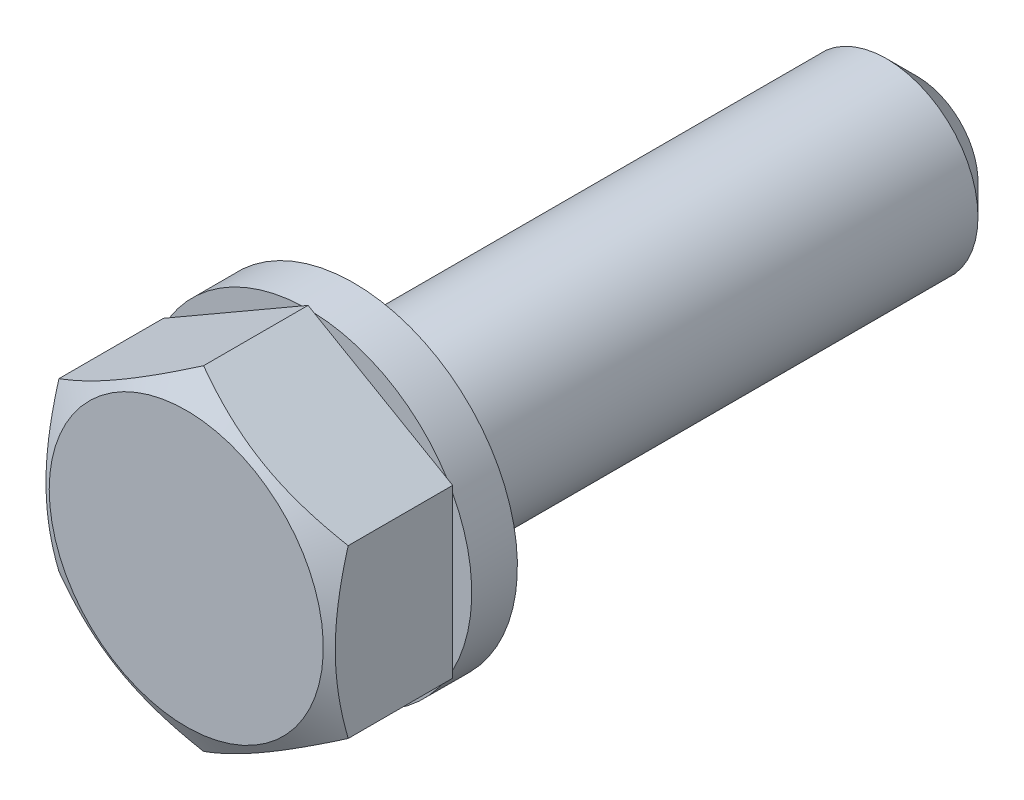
ISO-10303-21;
HEADER;
FILE_DESCRIPTION(('STEP AP214'),'2;1');
FILE_NAME('part.step','',(''),(''),'','','');
FILE_SCHEMA(('AUTOMOTIVE_DESIGN { 1 0 10303 214 1 1 1 1 }'));
ENDSEC;
DATA;
#1=APPLICATION_CONTEXT('core data for automotive mechanical design processes');
#2=APPLICATION_PROTOCOL_DEFINITION('international standard','automotive_design',2000,#1);
#3=PRODUCT_CONTEXT('',#1,'mechanical');
#4=PRODUCT('Part','Part','',(#3));
#5=PRODUCT_RELATED_PRODUCT_CATEGORY('part','',(#4));
#6=PRODUCT_DEFINITION_FORMATION('','',#4);
#7=PRODUCT_DEFINITION_CONTEXT('part definition',#1,'design');
#8=PRODUCT_DEFINITION('design','',#6,#7);
#9=PRODUCT_DEFINITION_SHAPE('','',#8);
#10=(LENGTH_UNIT() NAMED_UNIT(*) SI_UNIT(.MILLI.,.METRE.));
#11=(NAMED_UNIT(*) PLANE_ANGLE_UNIT() SI_UNIT($,.RADIAN.));
#12=(NAMED_UNIT(*) SI_UNIT($,.STERADIAN.) SOLID_ANGLE_UNIT());
#13=UNCERTAINTY_MEASURE_WITH_UNIT(LENGTH_MEASURE(1.E-05),#10,'distance_accuracy_value','');
#14=(GEOMETRIC_REPRESENTATION_CONTEXT(3) GLOBAL_UNCERTAINTY_ASSIGNED_CONTEXT((#13)) GLOBAL_UNIT_ASSIGNED_CONTEXT((#10,
#11,#12)) REPRESENTATION_CONTEXT('',''));
#15=CARTESIAN_POINT('',(0.,0.,0.));
#16=DIRECTION('',(0.,0.,1.));
#17=DIRECTION('',(1.,0.,0.));
#18=AXIS2_PLACEMENT_3D('',#15,#16,#17);
#19=CARTESIAN_POINT('',(0.,10.9696551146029,0.));
#20=DIRECTION('',(0.,0.,1.));
#21=DIRECTION('',(1.,0.,0.));
#22=AXIS2_PLACEMENT_3D('',#19,#20,#21);
#23=PLANE('',#22);
#24=CARTESIAN_POINT('',(0.,0.,0.));
#25=DIRECTION('',(0.,0.,-1.));
#26=DIRECTION('',(-1.,0.,0.));
#27=AXIS2_PLACEMENT_3D('',#24,#25,#26);
#28=CIRCLE('',#27,6.1);
#29=CARTESIAN_POINT('',(-6.1,0.,0.));
#30=VERTEX_POINT('',#29);
#31=EDGE_CURVE('E331',#30,#30,#28,.T.);
#32=ORIENTED_EDGE('',*,*,#31,.T.);
#33=EDGE_LOOP('',(#32));
#34=FACE_BOUND('',#33,.T.);
#35=CARTESIAN_POINT('',(0.,0.,0.));
#36=DIRECTION('',(0.,0.,1.));
#37=DIRECTION('',(1.,0.,0.));
#38=AXIS2_PLACEMENT_3D('',#35,#36,#37);
#39=CIRCLE('',#38,6.);
#40=CARTESIAN_POINT('',(6.,0.,0.));
#41=VERTEX_POINT('',#40);
#42=EDGE_CURVE('E175',#41,#41,#39,.F.);
#43=ORIENTED_EDGE('',*,*,#42,.F.);
#44=EDGE_LOOP('',(#43));
#45=FACE_BOUND('',#44,.T.);
#46=ADVANCED_FACE('F14',(#34,#45),#23,.F.);
#47=CARTESIAN_POINT('',(0.,0.,-40.));
#48=DIRECTION('',(0.,0.,1.));
#49=DIRECTION('',(1.,0.,0.));
#50=AXIS2_PLACEMENT_3D('',#47,#48,#49);
#51=CYLINDRICAL_SURFACE('',#50,6.);
#52=CARTESIAN_POINT('',(0.,0.,-38.));
#53=DIRECTION('',(0.,0.,-1.));
#54=DIRECTION('',(-1.,0.,0.));
#55=AXIS2_PLACEMENT_3D('',#52,#53,#54);
#56=CIRCLE('',#55,6.);
#57=CARTESIAN_POINT('',(-6.,0.,-38.));
#58=VERTEX_POINT('',#57);
#59=EDGE_CURVE('E9',#58,#58,#56,.F.);
#60=ORIENTED_EDGE('',*,*,#59,.T.);
#61=EDGE_LOOP('',(#60));
#62=FACE_BOUND('',#61,.T.);
#63=ORIENTED_EDGE('',*,*,#42,.T.);
#64=EDGE_LOOP('',(#63));
#65=FACE_BOUND('',#64,.T.);
#66=ADVANCED_FACE('F195',(#62,#65),#51,.T.);
#67=CARTESIAN_POINT('',(0.,0.,-40.));
#68=DIRECTION('',(0.,0.,-1.));
#69=DIRECTION('',(-1.,0.,0.));
#70=AXIS2_PLACEMENT_3D('',#67,#68,#69);
#71=PLANE('',#70);
#72=CARTESIAN_POINT('',(0.,0.,-40.));
#73=DIRECTION('',(0.,0.,-1.));
#74=DIRECTION('',(-1.,0.,0.));
#75=AXIS2_PLACEMENT_3D('',#72,#73,#74);
#76=CIRCLE('',#75,4.);
#77=CARTESIAN_POINT('',(-4.,0.,-40.));
#78=VERTEX_POINT('',#77);
#79=EDGE_CURVE('E22',#78,#78,#76,.T.);
#80=ORIENTED_EDGE('',*,*,#79,.T.);
#81=EDGE_LOOP('',(#80));
#82=FACE_BOUND('',#81,.T.);
#83=ADVANCED_FACE('F180',(#82),#71,.T.);
#84=CARTESIAN_POINT('',(0.,0.,-40.));
#85=DIRECTION('',(0.,0.,1.));
#86=DIRECTION('',(1.,0.,0.));
#87=AXIS2_PLACEMENT_3D('',#84,#85,#86);
#88=CONICAL_SURFACE('',#87,4.,0.785398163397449);
#89=ORIENTED_EDGE('',*,*,#59,.F.);
#90=EDGE_LOOP('',(#89));
#91=FACE_BOUND('',#90,.T.);
#92=ORIENTED_EDGE('',*,*,#79,.F.);
#93=EDGE_LOOP('',(#92));
#94=FACE_BOUND('',#93,.T.);
#95=ADVANCED_FACE('F16',(#91,#94),#88,.T.);
#96=CARTESIAN_POINT('',(0.,0.,0.));
#97=DIRECTION('',(0.,0.,-1.));
#98=DIRECTION('',(-1.,0.,0.));
#99=AXIS2_PLACEMENT_3D('',#96,#97,#98);
#100=PLANE('',#99);
#101=CARTESIAN_POINT('',(0.,0.,0.));
#102=DIRECTION('',(0.,0.,-1.));
#103=DIRECTION('',(-1.,0.,0.));
#104=AXIS2_PLACEMENT_3D('',#101,#102,#103);
#105=CIRCLE('',#104,10.75);
#106=CARTESIAN_POINT('',(0.392893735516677,10.7428178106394,0.));
#107=VERTEX_POINT('',#106);
#108=CARTESIAN_POINT('',(9.10710626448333,5.71166486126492,0.));
#109=VERTEX_POINT('',#108);
#110=EDGE_CURVE('E233',#107,#109,#105,.T.);
#111=ORIENTED_EDGE('',*,*,#110,.F.);
#112=DIRECTION('',(0.866025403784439,-0.5,0.));
#113=VECTOR('',#112,1.);
#114=CARTESIAN_POINT('',(9.5,5.48482755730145,0.));
#115=LINE('',#114,#113);
#116=EDGE_CURVE('E237',#107,#109,#115,.T.);
#117=ORIENTED_EDGE('',*,*,#116,.T.);
#118=EDGE_LOOP('',(#111,#117));
#119=FACE_BOUND('',#118,.T.);
#120=ADVANCED_FACE('F183',(#119),#100,.F.);
#121=CARTESIAN_POINT('',(-9.10710626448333,5.71166486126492,0.));
#122=VERTEX_POINT('',#121);
#123=CARTESIAN_POINT('',(-0.39289373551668,10.7428178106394,0.));
#124=VERTEX_POINT('',#123);
#125=EDGE_CURVE('E133',#122,#124,#105,.T.);
#126=ORIENTED_EDGE('',*,*,#125,.F.);
#127=DIRECTION('',(0.866025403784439,0.5,0.));
#128=VECTOR('',#127,1.);
#129=CARTESIAN_POINT('',(0.,10.9696551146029,0.));
#130=LINE('',#129,#128);
#131=EDGE_CURVE('E111',#122,#124,#130,.T.);
#132=ORIENTED_EDGE('',*,*,#131,.T.);
#133=EDGE_LOOP('',(#126,#132));
#134=FACE_BOUND('',#133,.T.);
#135=ADVANCED_FACE('F191',(#134),#100,.F.);
#136=CARTESIAN_POINT('',(-9.5,-5.03115294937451,0.));
#137=VERTEX_POINT('',#136);
#138=CARTESIAN_POINT('',(-9.5,5.03115294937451,0.));
#139=VERTEX_POINT('',#138);
#140=EDGE_CURVE('E107',#137,#139,#105,.T.);
#141=ORIENTED_EDGE('',*,*,#140,.F.);
#142=DIRECTION('',(0.,1.,0.));
#143=VECTOR('',#142,1.);
#144=CARTESIAN_POINT('',(-9.5,5.48482755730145,0.));
#145=LINE('',#144,#143);
#146=EDGE_CURVE('E104',#137,#139,#145,.T.);
#147=ORIENTED_EDGE('',*,*,#146,.T.);
#148=EDGE_LOOP('',(#141,#147));
#149=FACE_BOUND('',#148,.T.);
#150=ADVANCED_FACE('F106',(#149),#100,.F.);
#151=CARTESIAN_POINT('',(-0.392893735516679,-10.7428178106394,0.));
#152=VERTEX_POINT('',#151);
#153=CARTESIAN_POINT('',(-9.10710626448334,-5.71166486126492,0.));
#154=VERTEX_POINT('',#153);
#155=EDGE_CURVE('E525',#152,#154,#105,.T.);
#156=ORIENTED_EDGE('',*,*,#155,.F.);
#157=DIRECTION('',(-0.866025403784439,0.5,0.));
#158=VECTOR('',#157,1.);
#159=CARTESIAN_POINT('',(-9.5,-5.48482755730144,0.));
#160=LINE('',#159,#158);
#161=EDGE_CURVE('E112',#152,#154,#160,.T.);
#162=ORIENTED_EDGE('',*,*,#161,.T.);
#163=EDGE_LOOP('',(#156,#162));
#164=FACE_BOUND('',#163,.T.);
#165=ADVANCED_FACE('F435',(#164),#100,.F.);
#166=CARTESIAN_POINT('',(9.10710626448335,-5.7116648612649,0.));
#167=VERTEX_POINT('',#166);
#168=CARTESIAN_POINT('',(0.392893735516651,-10.7428178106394,0.));
#169=VERTEX_POINT('',#168);
#170=EDGE_CURVE('E524',#167,#169,#105,.T.);
#171=ORIENTED_EDGE('',*,*,#170,.F.);
#172=DIRECTION('',(-0.866025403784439,-0.5,0.));
#173=VECTOR('',#172,1.);
#174=CARTESIAN_POINT('',(0.,-10.9696551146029,0.));
#175=LINE('',#174,#173);
#176=EDGE_CURVE('E326',#167,#169,#175,.T.);
#177=ORIENTED_EDGE('',*,*,#176,.T.);
#178=EDGE_LOOP('',(#171,#177));
#179=FACE_BOUND('',#178,.T.);
#180=ADVANCED_FACE('F350',(#179),#100,.F.);
#181=CARTESIAN_POINT('',(9.5,5.03115294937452,0.));
#182=VERTEX_POINT('',#181);
#183=CARTESIAN_POINT('',(9.5,-5.03115294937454,0.));
#184=VERTEX_POINT('',#183);
#185=EDGE_CURVE('E234',#182,#184,#105,.T.);
#186=ORIENTED_EDGE('',*,*,#185,.F.);
#187=DIRECTION('',(0.,1.,0.));
#188=VECTOR('',#187,1.);
#189=CARTESIAN_POINT('',(9.5,-5.48482755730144,0.));
#190=LINE('',#189,#188);
#191=EDGE_CURVE('E159',#184,#182,#190,.T.);
#192=ORIENTED_EDGE('',*,*,#191,.F.);
#193=EDGE_LOOP('',(#186,#192));
#194=FACE_BOUND('',#193,.T.);
#195=ADVANCED_FACE('F194',(#194),#100,.F.);
#196=CARTESIAN_POINT('',(0.,0.,-3.));
#197=DIRECTION('',(0.,0.,-1.));
#198=DIRECTION('',(-1.,0.,0.));
#199=AXIS2_PLACEMENT_3D('',#196,#197,#198);
#200=PLANE('',#199);
#201=CARTESIAN_POINT('',(0.,0.,-3.));
#202=DIRECTION('',(0.,0.,-1.));
#203=DIRECTION('',(-1.,0.,0.));
#204=AXIS2_PLACEMENT_3D('',#201,#202,#203);
#205=CIRCLE('',#204,10.75);
#206=CARTESIAN_POINT('',(-10.75,0.,-3.));
#207=VERTEX_POINT('',#206);
#208=EDGE_CURVE('E132',#207,#207,#205,.T.);
#209=ORIENTED_EDGE('',*,*,#208,.T.);
#210=EDGE_LOOP('',(#209));
#211=FACE_BOUND('',#210,.T.);
#212=CARTESIAN_POINT('',(0.,0.,-3.));
#213=DIRECTION('',(0.,0.,-1.));
#214=DIRECTION('',(-1.,0.,0.));
#215=AXIS2_PLACEMENT_3D('',#212,#213,#214);
#216=CIRCLE('',#215,6.1);
#217=CARTESIAN_POINT('',(-6.1,0.,-3.));
#218=VERTEX_POINT('',#217);
#219=EDGE_CURVE('E124',#218,#218,#216,.T.);
#220=ORIENTED_EDGE('',*,*,#219,.F.);
#221=EDGE_LOOP('',(#220));
#222=FACE_BOUND('',#221,.T.);
#223=ADVANCED_FACE('F339',(#211,#222),#200,.T.);
#224=CARTESIAN_POINT('',(0.,0.,-3.));
#225=DIRECTION('',(0.,0.,1.));
#226=DIRECTION('',(1.,0.,0.));
#227=AXIS2_PLACEMENT_3D('',#224,#225,#226);
#228=CYLINDRICAL_SURFACE('',#227,10.75);
#229=ORIENTED_EDGE('',*,*,#208,.F.);
#230=EDGE_LOOP('',(#229));
#231=FACE_BOUND('',#230,.T.);
#232=EDGE_CURVE('E118',#139,#122,#105,.T.);
#233=ORIENTED_EDGE('',*,*,#232,.T.);
#234=ORIENTED_EDGE('',*,*,#125,.T.);
#235=EDGE_CURVE('E539',#124,#107,#105,.T.);
#236=ORIENTED_EDGE('',*,*,#235,.T.);
#237=ORIENTED_EDGE('',*,*,#110,.T.);
#238=EDGE_CURVE('E29',#109,#182,#105,.T.);
#239=ORIENTED_EDGE('',*,*,#238,.T.);
#240=ORIENTED_EDGE('',*,*,#185,.T.);
#241=EDGE_CURVE('E530',#184,#167,#105,.T.);
#242=ORIENTED_EDGE('',*,*,#241,.T.);
#243=ORIENTED_EDGE('',*,*,#170,.T.);
#244=EDGE_CURVE('E522',#169,#152,#105,.T.);
#245=ORIENTED_EDGE('',*,*,#244,.T.);
#246=ORIENTED_EDGE('',*,*,#155,.T.);
#247=EDGE_CURVE('E122',#154,#137,#105,.T.);
#248=ORIENTED_EDGE('',*,*,#247,.T.);
#249=ORIENTED_EDGE('',*,*,#140,.T.);
#250=EDGE_LOOP('',(#233,#234,#236,#237,#239,#240,#242,#243,#245,#246,#248,#249));
#251=FACE_BOUND('',#250,.T.);
#252=ADVANCED_FACE('F116',(#231,#251),#228,.T.);
#253=CARTESIAN_POINT('',(0.,0.,-3.));
#254=DIRECTION('',(0.,0.,1.));
#255=DIRECTION('',(1.,0.,0.));
#256=AXIS2_PLACEMENT_3D('',#253,#254,#255);
#257=CYLINDRICAL_SURFACE('',#256,6.1);
#258=ORIENTED_EDGE('',*,*,#219,.T.);
#259=EDGE_LOOP('',(#258));
#260=FACE_BOUND('',#259,.T.);
#261=ORIENTED_EDGE('',*,*,#31,.F.);
#262=EDGE_LOOP('',(#261));
#263=FACE_BOUND('',#262,.T.);
#264=ADVANCED_FACE('F336',(#260,#263),#257,.F.);
#265=CARTESIAN_POINT('',(0.,10.9696551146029,8.));
#266=DIRECTION('',(0.,0.,1.));
#267=DIRECTION('',(1.,0.,0.));
#268=AXIS2_PLACEMENT_3D('',#265,#266,#267);
#269=PLANE('',#268);
#270=CARTESIAN_POINT('',(0.,0.,8.));
#271=DIRECTION('',(0.,0.,-1.));
#272=DIRECTION('',(-1.,0.,0.));
#273=AXIS2_PLACEMENT_3D('',#270,#271,#272);
#274=CIRCLE('',#273,9.);
#275=CARTESIAN_POINT('',(-9.,0.,8.));
#276=VERTEX_POINT('',#275);
#277=EDGE_CURVE('E309',#276,#276,#274,.T.);
#278=ORIENTED_EDGE('',*,*,#277,.F.);
#279=EDGE_LOOP('',(#278));
#280=FACE_BOUND('',#279,.T.);
#281=ADVANCED_FACE('F261',(#280),#269,.T.);
#282=CARTESIAN_POINT('',(0.,0.,8.));
#283=DIRECTION('',(0.,0.,-1.));
#284=DIRECTION('',(-1.,0.,0.));
#285=AXIS2_PLACEMENT_3D('',#282,#283,#284);
#286=CONICAL_SURFACE('',#285,9.,1.0471975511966);
#287=ORIENTED_EDGE('',*,*,#277,.T.);
#288=EDGE_LOOP('',(#287));
#289=FACE_BOUND('',#288,.T.);
#290=CARTESIAN_POINT('',(-9.5002,5.48471208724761,6.86275242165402));
#291=CARTESIAN_POINT('',(-9.2913692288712,5.6052805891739,6.93235142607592));
#292=CARTESIAN_POINT('',(-9.0817598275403,5.72629863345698,6.99879155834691));
#293=CARTESIAN_POINT('',(-8.66086011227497,5.96930519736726,7.1244775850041));
#294=CARTESIAN_POINT('',(-8.44956926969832,6.09129402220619,7.18372111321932));
#295=CARTESIAN_POINT('',(-7.81229220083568,6.4592261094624,7.34951029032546));
#296=CARTESIAN_POINT('',(-7.38379023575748,6.70662183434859,7.44381042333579));
#297=CARTESIAN_POINT('',(-6.74255666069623,7.07683821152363,7.55438616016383));
#298=CARTESIAN_POINT('',(-6.53174078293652,7.19855281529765,7.58588503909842));
#299=CARTESIAN_POINT('',(-6.10913296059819,7.44254555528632,7.6387066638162));
#300=CARTESIAN_POINT('',(-5.89734099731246,7.56482370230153,7.66002921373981));
#301=CARTESIAN_POINT('',(-5.47340378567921,7.80958396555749,7.69195184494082));
#302=CARTESIAN_POINT('',(-5.26125925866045,7.93206566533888,7.70256466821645));
#303=CARTESIAN_POINT('',(-4.83677424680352,8.17714220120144,7.71284233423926));
#304=CARTESIAN_POINT('',(-4.62443376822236,8.29973703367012,7.71250751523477));
#305=CARTESIAN_POINT('',(-4.22745800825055,8.52893109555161,7.70165149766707));
#306=CARTESIAN_POINT('',(-4.04279470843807,8.63554650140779,7.6924545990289));
#307=CARTESIAN_POINT('',(-3.67389999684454,8.84852796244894,7.6659594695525));
#308=CARTESIAN_POINT('',(-3.48966861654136,8.95489399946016,7.64866066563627));
#309=CARTESIAN_POINT('',(-2.937688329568,9.27357996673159,7.585020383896));
#310=CARTESIAN_POINT('',(-2.57091646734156,9.48533580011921,7.52694296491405));
#311=CARTESIAN_POINT('',(-1.83348217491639,9.91109368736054,7.38174885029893));
#312=CARTESIAN_POINT('',(-1.46291385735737,10.1250414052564,7.29401669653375));
#313=CARTESIAN_POINT('',(-0.727303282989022,10.5497463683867,7.0949011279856));
#314=CARTESIAN_POINT('',(-0.362251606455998,10.7605090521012,6.98356447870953));
#315=CARTESIAN_POINT('',(0.000200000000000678,10.9697705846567,6.86275242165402));
#316=B_SPLINE_CURVE_WITH_KNOTS('',3,(#290,#291,#292,#293,#294,#295,#296,#297,#298,#299,#300,
#301,#302,#303,#304,#305,#306,#307,#308,#309,#310,#311,#312,#313,#314,#315),.UNSPECIFIED.,.F.,
.F.,(4,2,2,2,2,2,2,2,2,2,2,2,4),(0.,0.752880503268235,1.50600787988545,3.0154687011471,
3.75167336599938,4.48789219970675,5.22323407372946,5.95855322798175,6.59868084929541,
7.23885375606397,8.52010929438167,9.82978009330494,11.1368800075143),.UNSPECIFIED.);
#317=CARTESIAN_POINT('',(-9.5,5.48482755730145,6.86281908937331));
#318=VERTEX_POINT('',#317);
#319=CARTESIAN_POINT('',(0.,10.9696551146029,6.86281908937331));
#320=VERTEX_POINT('',#319);
#321=EDGE_CURVE('E249',#318,#320,#316,.T.);
#322=ORIENTED_EDGE('',*,*,#321,.F.);
#323=CARTESIAN_POINT('',(-9.5,-14.6169548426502,3.13127340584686));
#324=CARTESIAN_POINT('',(-9.5,-14.4099741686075,3.23146887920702));
#325=CARTESIAN_POINT('',(-9.5,-14.202747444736,3.33115583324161));
#326=CARTESIAN_POINT('',(-9.5,-13.7877505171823,3.52939728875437));
#327=CARTESIAN_POINT('',(-9.5,-13.5799803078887,3.62795177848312));
#328=CARTESIAN_POINT('',(-9.5,-12.9557203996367,3.92177017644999));
#329=CARTESIAN_POINT('',(-9.5,-12.5383444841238,4.11515839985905));
#330=CARTESIAN_POINT('',(-9.5,-11.6984328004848,4.49680738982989));
#331=CARTESIAN_POINT('',(-9.5,-11.275881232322,4.68503347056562));
#332=CARTESIAN_POINT('',(-9.5,-10.427377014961,5.05362894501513));
#333=CARTESIAN_POINT('',(-9.5,-10.0014245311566,5.23399871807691));
#334=CARTESIAN_POINT('',(-9.5,-9.1321608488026,5.59024054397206));
#335=CARTESIAN_POINT('',(-9.5,-8.68872080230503,5.76579995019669));
#336=CARTESIAN_POINT('',(-9.5,-7.79661127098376,6.10334897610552));
#337=CARTESIAN_POINT('',(-9.5,-7.34794119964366,6.26533705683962));
#338=CARTESIAN_POINT('',(-9.5,-6.44553024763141,6.57140492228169));
#339=CARTESIAN_POINT('',(-9.5,-5.9918021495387,6.71552198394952));
#340=CARTESIAN_POINT('',(-9.5,-5.07785587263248,6.98114937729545));
#341=CARTESIAN_POINT('',(-9.5,-4.61763982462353,7.10266695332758));
#342=CARTESIAN_POINT('',(-9.5,-3.69290280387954,7.31654154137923));
#343=CARTESIAN_POINT('',(-9.5,-3.22841826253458,7.40905177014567));
#344=CARTESIAN_POINT('',(-9.5,-2.52755616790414,7.52199749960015));
#345=CARTESIAN_POINT('',(-9.5,-2.29322816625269,7.55534437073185));
#346=CARTESIAN_POINT('',(-9.5,-1.82344730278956,7.61277502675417));
#347=CARTESIAN_POINT('',(-9.5,-1.58799455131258,7.6368597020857));
#348=CARTESIAN_POINT('',(-9.5,-1.11930437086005,7.67498999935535));
#349=CARTESIAN_POINT('',(-9.5,-0.886077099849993,7.68916002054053));
#350=CARTESIAN_POINT('',(-9.5,-0.419232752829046,7.70763310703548));
#351=CARTESIAN_POINT('',(-9.5,-0.185615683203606,7.71193633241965));
#352=CARTESIAN_POINT('',(-9.5,0.281592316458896,7.71057344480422));
#353=CARTESIAN_POINT('',(-9.5,0.515183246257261,7.70490724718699));
#354=CARTESIAN_POINT('',(-9.5,0.981922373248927,7.68374176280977));
#355=CARTESIAN_POINT('',(-9.5,1.2150705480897,7.66824199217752));
#356=CARTESIAN_POINT('',(-9.5,1.77895072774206,7.61918755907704));
#357=CARTESIAN_POINT('',(-9.5,2.10926686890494,7.5807701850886));
#358=CARTESIAN_POINT('',(-9.5,2.7673725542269,7.48631778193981));
#359=CARTESIAN_POINT('',(-9.5,3.09516173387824,7.43028025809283));
#360=CARTESIAN_POINT('',(-9.5,3.7479266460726,7.30258122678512));
#361=CARTESIAN_POINT('',(-9.5,4.07289990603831,7.23090720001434));
#362=CARTESIAN_POINT('',(-9.5,4.71955029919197,7.07411533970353));
#363=CARTESIAN_POINT('',(-9.5,5.04122748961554,6.98899774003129));
#364=CARTESIAN_POINT('',(-9.5,5.68830445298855,6.80538640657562));
#365=CARTESIAN_POINT('',(-9.5,6.01363245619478,6.70664147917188));
#366=CARTESIAN_POINT('',(-9.5,6.66108251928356,6.4992006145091));
#367=CARTESIAN_POINT('',(-9.5,6.98320455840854,6.39050461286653));
#368=CARTESIAN_POINT('',(-9.5,7.62440641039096,6.16486538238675));
#369=CARTESIAN_POINT('',(-9.5,7.94348725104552,6.04792506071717));
#370=CARTESIAN_POINT('',(-9.5,8.57902170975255,5.80714824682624));
#371=CARTESIAN_POINT('',(-9.5,8.89547535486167,5.68331182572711));
#372=CARTESIAN_POINT('',(-9.5,9.62674986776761,5.38942439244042));
#373=CARTESIAN_POINT('',(-9.5,10.0407133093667,5.21724339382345));
#374=CARTESIAN_POINT('',(-9.5,10.8652589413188,4.86494520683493));
#375=CARTESIAN_POINT('',(-9.5,11.2758409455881,4.68482758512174));
#376=CARTESIAN_POINT('',(-9.5,12.0942342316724,4.31820457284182));
#377=CARTESIAN_POINT('',(-9.5,12.5020449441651,4.1316979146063));
#378=CARTESIAN_POINT('',(-9.5,13.31526398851,3.75355025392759));
#379=CARTESIAN_POINT('',(-9.5,13.7206723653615,3.56190934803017));
#380=CARTESIAN_POINT('',(-9.5,14.5298828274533,3.17423557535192));
#381=CARTESIAN_POINT('',(-9.5,14.9336828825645,2.97819847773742));
#382=CARTESIAN_POINT('',(-9.5,15.7395764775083,2.58264906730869));
#383=CARTESIAN_POINT('',(-9.5,16.1416700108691,2.3831367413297));
#384=CARTESIAN_POINT('',(-9.5,17.3456966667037,1.78033515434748));
#385=CARTESIAN_POINT('',(-9.5,18.1454714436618,1.37273512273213));
#386=CARTESIAN_POINT('',(-9.5,19.6765506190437,0.58254582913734));
#387=CARTESIAN_POINT('',(-9.5,20.4081814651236,0.200586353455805));
#388=CARTESIAN_POINT('',(-9.5,21.8687212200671,-0.568553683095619));
#389=CARTESIAN_POINT('',(-9.5,22.5976300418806,-0.955734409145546));
#390=CARTESIAN_POINT('',(-9.5,24.0516280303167,-1.73318767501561));
#391=CARTESIAN_POINT('',(-9.5,24.7767221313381,-2.12345100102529));
#392=CARTESIAN_POINT('',(-9.5,26.2251609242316,-2.90712368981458));
#393=CARTESIAN_POINT('',(-9.5,26.9485057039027,-3.30053289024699));
#394=CARTESIAN_POINT('',(-9.5,27.671202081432,-3.69512170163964));
#395=B_SPLINE_CURVE_WITH_KNOTS('',3,(#323,#324,#325,#326,#327,#328,#329,#330,#331,#332,#333,
#334,#335,#336,#337,#338,#339,#340,#341,#342,#343,#344,#345,#346,#347,#348,#349,#350,#351,#352,
#353,#354,#355,#356,#357,#358,#359,#360,#361,#362,#363,#364,#365,#366,#367,#368,#369,#370,#371,
#372,#373,#374,#375,#376,#377,#378,#379,#380,#381,#382,#383,#384,#385,#386,#387,#388,#389,#390,
#391,#392,#393,#394),.UNSPECIFIED.,.F.,.F.,(4,2,2,2,2,2,2,2,2,2,2,2,2,2,2,2,2,2,2,2,2,2,2,2,2,2,
2,2,2,2,2,2,2,2,2,4),(0.,0.689869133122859,1.37974541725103,2.759708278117,4.14738140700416,
5.53498745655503,6.96559884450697,8.39637224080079,9.82410912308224,11.2513875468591,
12.670994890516,13.3809072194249,14.0907512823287,14.7915209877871,15.492279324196,
16.1930436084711,16.8938423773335,17.8909161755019,18.8881312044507,19.8861475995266,
20.8841466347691,21.9039067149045,22.923673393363,23.9430822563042,24.9624806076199,
26.307400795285,27.6523945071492,28.9976566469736,30.3428935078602,31.6894858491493,
33.0360832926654,35.7289597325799,38.2049401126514,40.6809990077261,43.1513353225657,
45.6215449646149),.UNSPECIFIED.);
#396=CARTESIAN_POINT('',(-9.5,-5.48482755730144,6.86281908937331));
#397=VERTEX_POINT('',#396);
#398=EDGE_CURVE('E288',#397,#318,#395,.T.);
#399=ORIENTED_EDGE('',*,*,#398,.F.);
#400=CARTESIAN_POINT('',(0.000199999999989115,-10.9697705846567,6.86275242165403));
#401=CARTESIAN_POINT('',(-0.20863077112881,-10.8492020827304,6.93235142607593));
#402=CARTESIAN_POINT('',(-0.418240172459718,-10.7281840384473,6.99879155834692));
#403=CARTESIAN_POINT('',(-0.839139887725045,-10.4851774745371,7.12447758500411));
#404=CARTESIAN_POINT('',(-1.05043073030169,-10.3631886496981,7.18372111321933));
#405=CARTESIAN_POINT('',(-1.68770779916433,-9.99525656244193,7.34951029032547));
#406=CARTESIAN_POINT('',(-2.11620976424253,-9.74786083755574,7.4438104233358));
#407=CARTESIAN_POINT('',(-2.75744333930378,-9.3776444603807,7.55438616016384));
#408=CARTESIAN_POINT('',(-2.96825921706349,-9.25592985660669,7.58588503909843));
#409=CARTESIAN_POINT('',(-3.39086703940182,-9.01193711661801,7.63870666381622));
#410=CARTESIAN_POINT('',(-3.60265900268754,-8.8896589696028,7.66002921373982));
#411=CARTESIAN_POINT('',(-4.0265962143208,-8.64489870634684,7.69195184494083));
#412=CARTESIAN_POINT('',(-4.23874074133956,-8.52241700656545,7.70256466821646));
#413=CARTESIAN_POINT('',(-4.66322575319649,-8.2773404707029,7.71284233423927));
#414=CARTESIAN_POINT('',(-4.87556623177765,-8.15474563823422,7.71250751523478));
#415=CARTESIAN_POINT('',(-5.27254199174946,-7.92555157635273,7.70165149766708));
#416=CARTESIAN_POINT('',(-5.45720529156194,-7.81893617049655,7.69245459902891));
#417=CARTESIAN_POINT('',(-5.82610000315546,-7.60595470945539,7.66595946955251));
#418=CARTESIAN_POINT('',(-6.01033138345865,-7.49958867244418,7.64866066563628));
#419=CARTESIAN_POINT('',(-6.56231167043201,-7.18090270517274,7.58502038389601));
#420=CARTESIAN_POINT('',(-6.92908353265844,-6.96914687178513,7.52694296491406));
#421=CARTESIAN_POINT('',(-7.66651782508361,-6.5433889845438,7.38174885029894));
#422=CARTESIAN_POINT('',(-8.03708614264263,-6.32944126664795,7.29401669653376));
#423=CARTESIAN_POINT('',(-8.77269671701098,-5.90473630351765,7.09490112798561));
#424=CARTESIAN_POINT('',(-9.137748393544,-5.69397361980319,6.98356447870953));
#425=CARTESIAN_POINT('',(-9.5002,-5.48471208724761,6.86275242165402));
#426=B_SPLINE_CURVE_WITH_KNOTS('',3,(#400,#401,#402,#403,#404,#405,#406,#407,#408,#409,#410,
#411,#412,#413,#414,#415,#416,#417,#418,#419,#420,#421,#422,#423,#424,#425),.UNSPECIFIED.,.F.,
.F.,(4,2,2,2,2,2,2,2,2,2,2,2,4),(0.,0.752880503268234,1.50600787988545,3.01546870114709,
3.75167336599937,4.48789219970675,5.22323407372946,5.95855322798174,6.5986808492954,
7.23885375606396,8.52010929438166,9.82978009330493,11.1368800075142),.UNSPECIFIED.);
#427=CARTESIAN_POINT('',(0.,-10.9696551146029,6.86281908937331));
#428=VERTEX_POINT('',#427);
#429=EDGE_CURVE('E282',#428,#397,#426,.T.);
#430=ORIENTED_EDGE('',*,*,#429,.F.);
#431=CARTESIAN_POINT('',(9.5002,-5.4847120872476,6.86275242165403));
#432=CARTESIAN_POINT('',(9.2913692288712,-5.6052805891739,6.93235142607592));
#433=CARTESIAN_POINT('',(9.0817598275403,-5.72629863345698,6.99879155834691));
#434=CARTESIAN_POINT('',(8.66086011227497,-5.96930519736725,7.1244775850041));
#435=CARTESIAN_POINT('',(8.44956926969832,-6.09129402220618,7.18372111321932));
#436=CARTESIAN_POINT('',(7.81229220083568,-6.4592261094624,7.34951029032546));
#437=CARTESIAN_POINT('',(7.38379023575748,-6.70662183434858,7.4438104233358));
#438=CARTESIAN_POINT('',(6.74255666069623,-7.07683821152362,7.55438616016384));
#439=CARTESIAN_POINT('',(6.53174078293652,-7.19855281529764,7.58588503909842));
#440=CARTESIAN_POINT('',(6.10913296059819,-7.44254555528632,7.63870666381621));
#441=CARTESIAN_POINT('',(5.89734099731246,-7.56482370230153,7.66002921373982));
#442=CARTESIAN_POINT('',(5.47340378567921,-7.80958396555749,7.69195184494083));
#443=CARTESIAN_POINT('',(5.26125925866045,-7.93206566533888,7.70256466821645));
#444=CARTESIAN_POINT('',(4.83677424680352,-8.17714220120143,7.71284233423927));
#445=CARTESIAN_POINT('',(4.62443376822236,-8.29973703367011,7.71250751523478));
#446=CARTESIAN_POINT('',(4.22745800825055,-8.5289310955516,7.70165149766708));
#447=CARTESIAN_POINT('',(4.04279470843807,-8.63554650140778,7.69245459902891));
#448=CARTESIAN_POINT('',(3.67389999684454,-8.84852796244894,7.6659594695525));
#449=CARTESIAN_POINT('',(3.48966861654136,-8.95489399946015,7.64866066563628));
#450=CARTESIAN_POINT('',(2.937688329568,-9.27357996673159,7.58502038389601));
#451=CARTESIAN_POINT('',(2.57091646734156,-9.4853358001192,7.52694296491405));
#452=CARTESIAN_POINT('',(1.83348217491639,-9.91109368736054,7.38174885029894));
#453=CARTESIAN_POINT('',(1.46291385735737,-10.1250414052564,7.29401669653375));
#454=CARTESIAN_POINT('',(0.727303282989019,-10.5497463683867,7.09490112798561));
#455=CARTESIAN_POINT('',(0.362251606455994,-10.7605090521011,6.98356447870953));
#456=CARTESIAN_POINT('',(-0.000200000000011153,-10.9697705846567,6.86275242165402));
#457=B_SPLINE_CURVE_WITH_KNOTS('',3,(#431,#432,#433,#434,#435,#436,#437,#438,#439,#440,#441,
#442,#443,#444,#445,#446,#447,#448,#449,#450,#451,#452,#453,#454,#455,#456),.UNSPECIFIED.,.F.,
.F.,(4,2,2,2,2,2,2,2,2,2,2,2,4),(0.,0.752880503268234,1.50600787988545,3.0154687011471,
3.75167336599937,4.48789219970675,5.22323407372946,5.95855322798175,6.59868084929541,
7.23885375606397,8.52010929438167,9.82978009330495,11.1368800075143),.UNSPECIFIED.);
#458=CARTESIAN_POINT('',(9.5,-5.48482755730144,6.86281908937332));
#459=VERTEX_POINT('',#458);
#460=EDGE_CURVE('E37',#459,#428,#457,.T.);
#461=ORIENTED_EDGE('',*,*,#460,.F.);
#462=CARTESIAN_POINT('',(9.5,-14.6169548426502,3.13127340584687));
#463=CARTESIAN_POINT('',(9.5,-14.4099741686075,3.23146887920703));
#464=CARTESIAN_POINT('',(9.49999999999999,-14.202747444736,3.33115583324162));
#465=CARTESIAN_POINT('',(9.49999999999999,-13.7877505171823,3.52939728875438));
#466=CARTESIAN_POINT('',(9.49999999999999,-13.5799803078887,3.62795177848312));
#467=CARTESIAN_POINT('',(9.49999999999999,-12.9557203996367,3.92177017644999));
#468=CARTESIAN_POINT('',(9.5,-12.5383444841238,4.11515839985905));
#469=CARTESIAN_POINT('',(9.5,-11.6984328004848,4.4968073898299));
#470=CARTESIAN_POINT('',(9.5,-11.275881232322,4.68503347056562));
#471=CARTESIAN_POINT('',(9.5,-10.427377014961,5.05362894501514));
#472=CARTESIAN_POINT('',(9.5,-10.0014245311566,5.23399871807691));
#473=CARTESIAN_POINT('',(9.5,-9.1321608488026,5.59024054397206));
#474=CARTESIAN_POINT('',(9.5,-8.68872080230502,5.7657999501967));
#475=CARTESIAN_POINT('',(9.5,-7.79661127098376,6.10334897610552));
#476=CARTESIAN_POINT('',(9.5,-7.34794119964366,6.26533705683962));
#477=CARTESIAN_POINT('',(9.5,-6.44553024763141,6.57140492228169));
#478=CARTESIAN_POINT('',(9.5,-5.9918021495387,6.71552198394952));
#479=CARTESIAN_POINT('',(9.5,-5.07785587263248,6.98114937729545));
#480=CARTESIAN_POINT('',(9.5,-4.61763982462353,7.10266695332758));
#481=CARTESIAN_POINT('',(9.5,-3.69290280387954,7.31654154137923));
#482=CARTESIAN_POINT('',(9.5,-3.22841826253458,7.40905177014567));
#483=CARTESIAN_POINT('',(9.5,-2.52755616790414,7.52199749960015));
#484=CARTESIAN_POINT('',(9.5,-2.29322816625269,7.55534437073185));
#485=CARTESIAN_POINT('',(9.5,-1.82344730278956,7.61277502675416));
#486=CARTESIAN_POINT('',(9.5,-1.58799455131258,7.63685970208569));
#487=CARTESIAN_POINT('',(9.5,-1.11930437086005,7.67498999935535));
#488=CARTESIAN_POINT('',(9.5,-0.886077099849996,7.68916002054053));
#489=CARTESIAN_POINT('',(9.5,-0.419232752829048,7.70763310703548));
#490=CARTESIAN_POINT('',(9.5,-0.185615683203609,7.71193633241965));
#491=CARTESIAN_POINT('',(9.5,0.281592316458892,7.71057344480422));
#492=CARTESIAN_POINT('',(9.50000000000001,0.515183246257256,7.70490724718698));
#493=CARTESIAN_POINT('',(9.5,0.981922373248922,7.68374176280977));
#494=CARTESIAN_POINT('',(9.5,1.2150705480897,7.66824199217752));
#495=CARTESIAN_POINT('',(9.5,1.77895072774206,7.61918755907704));
#496=CARTESIAN_POINT('',(9.5,2.10926686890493,7.5807701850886));
#497=CARTESIAN_POINT('',(9.50000000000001,2.76737255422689,7.4863177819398));
#498=CARTESIAN_POINT('',(9.50000000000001,3.09516173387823,7.43028025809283));
#499=CARTESIAN_POINT('',(9.50000000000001,3.74792664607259,7.30258122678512));
#500=CARTESIAN_POINT('',(9.50000000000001,4.0728999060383,7.23090720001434));
#501=CARTESIAN_POINT('',(9.50000000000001,4.71955029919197,7.07411533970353));
#502=CARTESIAN_POINT('',(9.50000000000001,5.04122748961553,6.98899774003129));
#503=CARTESIAN_POINT('',(9.50000000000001,5.68830445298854,6.80538640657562));
#504=CARTESIAN_POINT('',(9.50000000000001,6.01363245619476,6.70664147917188));
#505=CARTESIAN_POINT('',(9.50000000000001,6.66108251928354,6.4992006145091));
#506=CARTESIAN_POINT('',(9.50000000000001,6.98320455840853,6.39050461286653));
#507=CARTESIAN_POINT('',(9.50000000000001,7.62440641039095,6.16486538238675));
#508=CARTESIAN_POINT('',(9.50000000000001,7.94348725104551,6.04792506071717));
#509=CARTESIAN_POINT('',(9.50000000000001,8.57902170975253,5.80714824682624));
#510=CARTESIAN_POINT('',(9.5,8.89547535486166,5.68331182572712));
#511=CARTESIAN_POINT('',(9.5,9.6267498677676,5.38942439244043));
#512=CARTESIAN_POINT('',(9.50000000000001,10.0407133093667,5.21724339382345));
#513=CARTESIAN_POINT('',(9.50000000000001,10.8652589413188,4.86494520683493));
#514=CARTESIAN_POINT('',(9.50000000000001,11.2758409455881,4.68482758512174));
#515=CARTESIAN_POINT('',(9.50000000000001,12.0942342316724,4.31820457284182));
#516=CARTESIAN_POINT('',(9.50000000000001,12.502044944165,4.1316979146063));
#517=CARTESIAN_POINT('',(9.50000000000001,13.3152639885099,3.75355025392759));
#518=CARTESIAN_POINT('',(9.50000000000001,13.7206723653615,3.56190934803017));
#519=CARTESIAN_POINT('',(9.50000000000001,14.5298828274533,3.17423557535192));
#520=CARTESIAN_POINT('',(9.50000000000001,14.9336828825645,2.97819847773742));
#521=CARTESIAN_POINT('',(9.50000000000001,15.7395764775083,2.58264906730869));
#522=CARTESIAN_POINT('',(9.50000000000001,16.1416700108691,2.3831367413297));
#523=CARTESIAN_POINT('',(9.50000000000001,17.3456966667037,1.78033515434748));
#524=CARTESIAN_POINT('',(9.50000000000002,18.1454714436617,1.37273512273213));
#525=CARTESIAN_POINT('',(9.50000000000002,19.6765506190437,0.58254582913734));
#526=CARTESIAN_POINT('',(9.50000000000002,20.4081814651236,0.200586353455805));
#527=CARTESIAN_POINT('',(9.50000000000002,21.8687212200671,-0.568553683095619));
#528=CARTESIAN_POINT('',(9.50000000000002,22.5976300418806,-0.955734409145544));
#529=CARTESIAN_POINT('',(9.50000000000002,24.0516280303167,-1.73318767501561));
#530=CARTESIAN_POINT('',(9.50000000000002,24.776722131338,-2.12345100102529));
#531=CARTESIAN_POINT('',(9.50000000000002,26.2251609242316,-2.90712368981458));
#532=CARTESIAN_POINT('',(9.50000000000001,26.9485057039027,-3.30053289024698));
#533=CARTESIAN_POINT('',(9.5,27.671202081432,-3.69512170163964));
#534=B_SPLINE_CURVE_WITH_KNOTS('',3,(#462,#463,#464,#465,#466,#467,#468,#469,#470,#471,#472,
#473,#474,#475,#476,#477,#478,#479,#480,#481,#482,#483,#484,#485,#486,#487,#488,#489,#490,#491,
#492,#493,#494,#495,#496,#497,#498,#499,#500,#501,#502,#503,#504,#505,#506,#507,#508,#509,#510,
#511,#512,#513,#514,#515,#516,#517,#518,#519,#520,#521,#522,#523,#524,#525,#526,#527,#528,#529,
#530,#531,#532,#533),.UNSPECIFIED.,.F.,.F.,(4,2,2,2,2,2,2,2,2,2,2,2,2,2,2,2,2,2,2,2,2,2,2,2,2,2,
2,2,2,2,2,2,2,2,2,4),(0.,0.689869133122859,1.37974541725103,2.759708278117,4.14738140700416,
5.53498745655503,6.96559884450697,8.39637224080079,9.82410912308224,11.251387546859,
12.670994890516,13.3809072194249,14.0907512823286,14.7915209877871,15.492279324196,
16.1930436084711,16.8938423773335,17.8909161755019,18.8881312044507,19.8861475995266,
20.8841466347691,21.9039067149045,22.923673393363,23.9430822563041,24.9624806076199,
26.307400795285,27.6523945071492,28.9976566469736,30.3428935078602,31.6894858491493,
33.0360832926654,35.7289597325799,38.2049401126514,40.6809990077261,43.1513353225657,
45.6215449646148),.UNSPECIFIED.);
#535=CARTESIAN_POINT('',(9.5,5.48482755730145,6.86281908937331));
#536=VERTEX_POINT('',#535);
#537=EDGE_CURVE('E266',#536,#459,#534,.F.);
#538=ORIENTED_EDGE('',*,*,#537,.F.);
#539=CARTESIAN_POINT('',(-0.0002,10.9697705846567,6.86275242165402));
#540=CARTESIAN_POINT('',(0.208630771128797,10.8492020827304,6.93235142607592));
#541=CARTESIAN_POINT('',(0.418240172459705,10.7281840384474,6.99879155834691));
#542=CARTESIAN_POINT('',(0.839139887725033,10.4851774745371,7.1244775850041));
#543=CARTESIAN_POINT('',(1.05043073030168,10.3631886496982,7.18372111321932));
#544=CARTESIAN_POINT('',(1.68770779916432,9.99525656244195,7.34951029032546));
#545=CARTESIAN_POINT('',(2.11620976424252,9.74786083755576,7.44381042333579));
#546=CARTESIAN_POINT('',(2.75744333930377,9.37764446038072,7.55438616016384));
#547=CARTESIAN_POINT('',(2.96825921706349,9.2559298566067,7.58588503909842));
#548=CARTESIAN_POINT('',(3.39086703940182,9.01193711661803,7.63870666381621));
#549=CARTESIAN_POINT('',(3.60265900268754,8.88965896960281,7.66002921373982));
#550=CARTESIAN_POINT('',(4.02659621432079,8.64489870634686,7.69195184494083));
#551=CARTESIAN_POINT('',(4.23874074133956,8.52241700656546,7.70256466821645));
#552=CARTESIAN_POINT('',(4.66322575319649,8.27734047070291,7.71284233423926));
#553=CARTESIAN_POINT('',(4.87556623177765,8.15474563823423,7.71250751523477));
#554=CARTESIAN_POINT('',(5.27254199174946,7.92555157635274,7.70165149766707));
#555=CARTESIAN_POINT('',(5.45720529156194,7.81893617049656,7.69245459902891));
#556=CARTESIAN_POINT('',(5.82610000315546,7.60595470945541,7.6659594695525));
#557=CARTESIAN_POINT('',(6.01033138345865,7.49958867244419,7.64866066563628));
#558=CARTESIAN_POINT('',(6.56231167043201,7.18090270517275,7.58502038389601));
#559=CARTESIAN_POINT('',(6.92908353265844,6.96914687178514,7.52694296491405));
#560=CARTESIAN_POINT('',(7.66651782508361,6.54338898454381,7.38174885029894));
#561=CARTESIAN_POINT('',(8.03708614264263,6.32944126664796,7.29401669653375));
#562=CARTESIAN_POINT('',(8.77269671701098,5.90473630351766,7.09490112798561));
#563=CARTESIAN_POINT('',(9.137748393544,5.6939736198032,6.98356447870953));
#564=CARTESIAN_POINT('',(9.5002,5.48471208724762,6.86275242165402));
#565=B_SPLINE_CURVE_WITH_KNOTS('',3,(#539,#540,#541,#542,#543,#544,#545,#546,#547,#548,#549,
#550,#551,#552,#553,#554,#555,#556,#557,#558,#559,#560,#561,#562,#563,#564),.UNSPECIFIED.,.F.,
.F.,(4,2,2,2,2,2,2,2,2,2,2,2,4),(0.,0.752880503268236,1.50600787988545,3.0154687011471,
3.75167336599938,4.48789219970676,5.22323407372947,5.95855322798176,6.59868084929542,
7.23885375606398,8.52010929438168,9.82978009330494,11.1368800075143),.UNSPECIFIED.);
#566=EDGE_CURVE('E241',#320,#536,#565,.T.);
#567=ORIENTED_EDGE('',*,*,#566,.F.);
#568=EDGE_LOOP('',(#322,#399,#430,#461,#538,#567));
#569=FACE_BOUND('',#568,.T.);
#570=ADVANCED_FACE('F257',(#289,#569),#286,.T.);
#571=CARTESIAN_POINT('',(9.5,-5.48482755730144,8.));
#572=DIRECTION('',(-1.,0.,0.));
#573=DIRECTION('',(0.,-1.,0.));
#574=AXIS2_PLACEMENT_3D('',#571,#572,#573);
#575=PLANE('',#574);
#576=DIRECTION('',(0.,0.,-1.));
#577=VECTOR('',#576,1.);
#578=CARTESIAN_POINT('',(9.5,5.48482755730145,8.));
#579=LINE('',#578,#577);
#580=CARTESIAN_POINT('',(9.5,5.48482755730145,0.));
#581=VERTEX_POINT('',#580);
#582=EDGE_CURVE('E158',#536,#581,#579,.T.);
#583=ORIENTED_EDGE('',*,*,#582,.F.);
#584=ORIENTED_EDGE('',*,*,#537,.T.);
#585=DIRECTION('',(0.,0.,-1.));
#586=VECTOR('',#585,1.);
#587=CARTESIAN_POINT('',(9.5,-5.48482755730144,8.));
#588=LINE('',#587,#586);
#589=CARTESIAN_POINT('',(9.5,-5.48482755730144,0.));
#590=VERTEX_POINT('',#589);
#591=EDGE_CURVE('E162',#459,#590,#588,.T.);
#592=ORIENTED_EDGE('',*,*,#591,.T.);
#593=EDGE_CURVE('E155',#590,#184,#190,.T.);
#594=ORIENTED_EDGE('',*,*,#593,.T.);
#595=ORIENTED_EDGE('',*,*,#191,.T.);
#596=EDGE_CURVE('E154',#182,#581,#190,.T.);
#597=ORIENTED_EDGE('',*,*,#596,.T.);
#598=EDGE_LOOP('',(#583,#584,#592,#594,#595,#597));
#599=FACE_BOUND('',#598,.T.);
#600=ADVANCED_FACE('F260',(#599),#575,.F.);
#601=CARTESIAN_POINT('',(0.,-10.9696551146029,8.));
#602=DIRECTION('',(-0.5,0.866025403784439,0.));
#603=DIRECTION('',(-0.866025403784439,-0.5,0.));
#604=AXIS2_PLACEMENT_3D('',#601,#602,#603);
#605=PLANE('',#604);
#606=ORIENTED_EDGE('',*,*,#591,.F.);
#607=ORIENTED_EDGE('',*,*,#460,.T.);
#608=DIRECTION('',(0.,0.,-1.));
#609=VECTOR('',#608,1.);
#610=CARTESIAN_POINT('',(0.,-10.9696551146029,8.));
#611=LINE('',#610,#609);
#612=CARTESIAN_POINT('',(0.,-10.9696551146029,0.));
#613=VERTEX_POINT('',#612);
#614=EDGE_CURVE('E165',#428,#613,#611,.T.);
#615=ORIENTED_EDGE('',*,*,#614,.T.);
#616=DIRECTION('',(0.866025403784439,0.5,0.));
#617=VECTOR('',#616,1.);
#618=CARTESIAN_POINT('',(0.,-10.9696551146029,0.));
#619=LINE('',#618,#617);
#620=EDGE_CURVE('E151',#613,#169,#619,.T.);
#621=ORIENTED_EDGE('',*,*,#620,.T.);
#622=ORIENTED_EDGE('',*,*,#176,.F.);
#623=EDGE_CURVE('E150',#167,#590,#619,.T.);
#624=ORIENTED_EDGE('',*,*,#623,.T.);
#625=EDGE_LOOP('',(#606,#607,#615,#621,#622,#624));
#626=FACE_BOUND('',#625,.T.);
#627=ADVANCED_FACE('F379',(#626),#605,.F.);
#628=CARTESIAN_POINT('',(-9.5,-5.48482755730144,8.));
#629=DIRECTION('',(0.5,0.866025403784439,0.));
#630=DIRECTION('',(-0.866025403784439,0.5,0.));
#631=AXIS2_PLACEMENT_3D('',#628,#629,#630);
#632=PLANE('',#631);
#633=ORIENTED_EDGE('',*,*,#614,.F.);
#634=ORIENTED_EDGE('',*,*,#429,.T.);
#635=DIRECTION('',(0.,0.,-1.));
#636=VECTOR('',#635,1.);
#637=CARTESIAN_POINT('',(-9.5,-5.48482755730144,8.));
#638=LINE('',#637,#636);
#639=CARTESIAN_POINT('',(-9.5,-5.48482755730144,0.));
#640=VERTEX_POINT('',#639);
#641=EDGE_CURVE('E168',#397,#640,#638,.T.);
#642=ORIENTED_EDGE('',*,*,#641,.T.);
#643=DIRECTION('',(0.866025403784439,-0.5,0.));
#644=VECTOR('',#643,1.);
#645=CARTESIAN_POINT('',(-9.5,-5.48482755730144,0.));
#646=LINE('',#645,#644);
#647=EDGE_CURVE('E143',#640,#154,#646,.T.);
#648=ORIENTED_EDGE('',*,*,#647,.T.);
#649=ORIENTED_EDGE('',*,*,#161,.F.);
#650=EDGE_CURVE('E140',#152,#613,#646,.T.);
#651=ORIENTED_EDGE('',*,*,#650,.T.);
#652=EDGE_LOOP('',(#633,#634,#642,#648,#649,#651));
#653=FACE_BOUND('',#652,.T.);
#654=ADVANCED_FACE('F296',(#653),#632,.F.);
#655=CARTESIAN_POINT('',(-9.5,5.48482755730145,8.));
#656=DIRECTION('',(1.,0.,0.));
#657=DIRECTION('',(0.,0.,-1.));
#658=AXIS2_PLACEMENT_3D('',#655,#656,#657);
#659=PLANE('',#658);
#660=ORIENTED_EDGE('',*,*,#641,.F.);
#661=ORIENTED_EDGE('',*,*,#398,.T.);
#662=DIRECTION('',(0.,0.,-1.));
#663=VECTOR('',#662,1.);
#664=CARTESIAN_POINT('',(-9.5,5.48482755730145,8.));
#665=LINE('',#664,#663);
#666=CARTESIAN_POINT('',(-9.5,5.48482755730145,0.));
#667=VERTEX_POINT('',#666);
#668=EDGE_CURVE('E139',#318,#667,#665,.T.);
#669=ORIENTED_EDGE('',*,*,#668,.T.);
#670=DIRECTION('',(0.,-1.,0.));
#671=VECTOR('',#670,1.);
#672=CARTESIAN_POINT('',(-9.5,5.48482755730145,0.));
#673=LINE('',#672,#671);
#674=EDGE_CURVE('E129',#667,#139,#673,.T.);
#675=ORIENTED_EDGE('',*,*,#674,.T.);
#676=ORIENTED_EDGE('',*,*,#146,.F.);
#677=EDGE_CURVE('E141',#137,#640,#673,.T.);
#678=ORIENTED_EDGE('',*,*,#677,.T.);
#679=EDGE_LOOP('',(#660,#661,#669,#675,#676,#678));
#680=FACE_BOUND('',#679,.T.);
#681=ADVANCED_FACE('F136',(#680),#659,.F.);
#682=CARTESIAN_POINT('',(0.,10.9696551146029,8.));
#683=DIRECTION('',(0.5,-0.866025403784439,0.));
#684=DIRECTION('',(0.866025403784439,0.5,0.));
#685=AXIS2_PLACEMENT_3D('',#682,#683,#684);
#686=PLANE('',#685);
#687=ORIENTED_EDGE('',*,*,#668,.F.);
#688=ORIENTED_EDGE('',*,*,#321,.T.);
#689=DIRECTION('',(0.,0.,-1.));
#690=VECTOR('',#689,1.);
#691=CARTESIAN_POINT('',(0.,10.9696551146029,8.));
#692=LINE('',#691,#690);
#693=CARTESIAN_POINT('',(0.,10.9696551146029,0.));
#694=VERTEX_POINT('',#693);
#695=EDGE_CURVE('E172',#320,#694,#692,.T.);
#696=ORIENTED_EDGE('',*,*,#695,.T.);
#697=DIRECTION('',(-0.866025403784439,-0.5,0.));
#698=VECTOR('',#697,1.);
#699=CARTESIAN_POINT('',(0.,10.9696551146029,0.));
#700=LINE('',#699,#698);
#701=EDGE_CURVE('E145',#694,#124,#700,.T.);
#702=ORIENTED_EDGE('',*,*,#701,.T.);
#703=ORIENTED_EDGE('',*,*,#131,.F.);
#704=EDGE_CURVE('E130',#122,#667,#700,.T.);
#705=ORIENTED_EDGE('',*,*,#704,.T.);
#706=EDGE_LOOP('',(#687,#688,#696,#702,#703,#705));
#707=FACE_BOUND('',#706,.T.);
#708=ADVANCED_FACE('F226',(#707),#686,.F.);
#709=CARTESIAN_POINT('',(9.5,5.48482755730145,8.));
#710=DIRECTION('',(-0.5,-0.866025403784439,0.));
#711=DIRECTION('',(0.866025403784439,-0.5,0.));
#712=AXIS2_PLACEMENT_3D('',#709,#710,#711);
#713=PLANE('',#712);
#714=ORIENTED_EDGE('',*,*,#695,.F.);
#715=ORIENTED_EDGE('',*,*,#566,.T.);
#716=ORIENTED_EDGE('',*,*,#582,.T.);
#717=DIRECTION('',(-0.866025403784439,0.5,0.));
#718=VECTOR('',#717,1.);
#719=CARTESIAN_POINT('',(9.5,5.48482755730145,0.));
#720=LINE('',#719,#718);
#721=EDGE_CURVE('E231',#581,#109,#720,.T.);
#722=ORIENTED_EDGE('',*,*,#721,.T.);
#723=ORIENTED_EDGE('',*,*,#116,.F.);
#724=EDGE_CURVE('E240',#107,#694,#720,.T.);
#725=ORIENTED_EDGE('',*,*,#724,.T.);
#726=EDGE_LOOP('',(#714,#715,#716,#722,#723,#725));
#727=FACE_BOUND('',#726,.T.);
#728=ADVANCED_FACE('F218',(#727),#713,.F.);
#729=ORIENTED_EDGE('',*,*,#238,.F.);
#730=ORIENTED_EDGE('',*,*,#721,.F.);
#731=ORIENTED_EDGE('',*,*,#596,.F.);
#732=EDGE_LOOP('',(#729,#730,#731));
#733=FACE_BOUND('',#732,.T.);
#734=ADVANCED_FACE('F202',(#733),#23,.F.);
#735=ORIENTED_EDGE('',*,*,#235,.F.);
#736=ORIENTED_EDGE('',*,*,#701,.F.);
#737=ORIENTED_EDGE('',*,*,#724,.F.);
#738=EDGE_LOOP('',(#735,#736,#737));
#739=FACE_BOUND('',#738,.T.);
#740=ADVANCED_FACE('F217',(#739),#23,.F.);
#741=ORIENTED_EDGE('',*,*,#232,.F.);
#742=ORIENTED_EDGE('',*,*,#674,.F.);
#743=ORIENTED_EDGE('',*,*,#704,.F.);
#744=EDGE_LOOP('',(#741,#742,#743));
#745=FACE_BOUND('',#744,.T.);
#746=ADVANCED_FACE('F128',(#745),#23,.F.);
#747=ORIENTED_EDGE('',*,*,#247,.F.);
#748=ORIENTED_EDGE('',*,*,#647,.F.);
#749=ORIENTED_EDGE('',*,*,#677,.F.);
#750=EDGE_LOOP('',(#747,#748,#749));
#751=FACE_BOUND('',#750,.T.);
#752=ADVANCED_FACE('F322',(#751),#23,.F.);
#753=ORIENTED_EDGE('',*,*,#244,.F.);
#754=ORIENTED_EDGE('',*,*,#620,.F.);
#755=ORIENTED_EDGE('',*,*,#650,.F.);
#756=EDGE_LOOP('',(#753,#754,#755));
#757=FACE_BOUND('',#756,.T.);
#758=ADVANCED_FACE('F214',(#757),#23,.F.);
#759=ORIENTED_EDGE('',*,*,#241,.F.);
#760=ORIENTED_EDGE('',*,*,#593,.F.);
#761=ORIENTED_EDGE('',*,*,#623,.F.);
#762=EDGE_LOOP('',(#759,#760,#761));
#763=FACE_BOUND('',#762,.T.);
#764=ADVANCED_FACE('F201',(#763),#23,.F.);
#765=CLOSED_SHELL('',(#46,#66,#83,#95,#120,#135,#150,#165,#180,#195,#223,#252,#264,#281,#570,
#600,#627,#654,#681,#708,#728,#734,#740,#746,#752,#758,#764));
#766=MANIFOLD_SOLID_BREP('B1',#765);
#767=ADVANCED_BREP_SHAPE_REPRESENTATION('',(#18,#766),#14);
#768=SHAPE_DEFINITION_REPRESENTATION(#9,#767);
ENDSEC;
END-ISO-10303-21;
